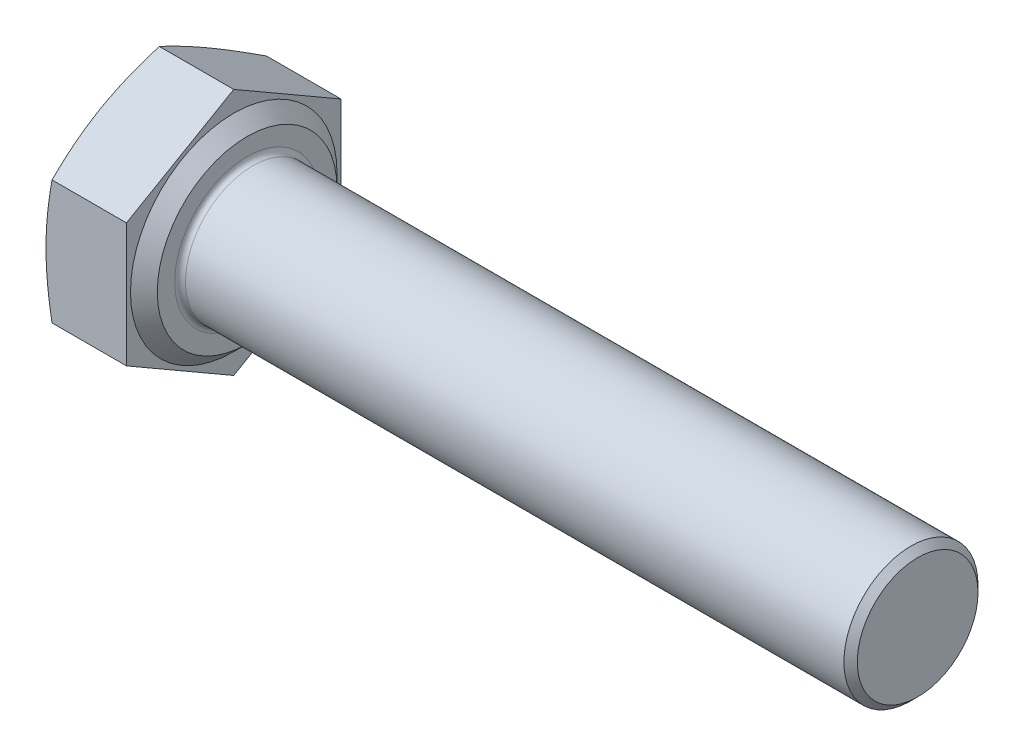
ISO-10303-21;
HEADER;
FILE_DESCRIPTION(('STEP AP214'),'2;1');
FILE_NAME('part.step','',(''),(''),'','','');
FILE_SCHEMA(('AUTOMOTIVE_DESIGN { 1 0 10303 214 1 1 1 1 }'));
ENDSEC;
DATA;
#1=APPLICATION_CONTEXT('core data for automotive mechanical design processes');
#2=APPLICATION_PROTOCOL_DEFINITION('international standard','automotive_design',2000,#1);
#3=PRODUCT_CONTEXT('',#1,'mechanical');
#4=PRODUCT('Part','Part','',(#3));
#5=PRODUCT_RELATED_PRODUCT_CATEGORY('part','',(#4));
#6=PRODUCT_DEFINITION_FORMATION('','',#4);
#7=PRODUCT_DEFINITION_CONTEXT('part definition',#1,'design');
#8=PRODUCT_DEFINITION('design','',#6,#7);
#9=PRODUCT_DEFINITION_SHAPE('','',#8);
#10=(LENGTH_UNIT() NAMED_UNIT(*) SI_UNIT(.MILLI.,.METRE.));
#11=(NAMED_UNIT(*) PLANE_ANGLE_UNIT() SI_UNIT($,.RADIAN.));
#12=(NAMED_UNIT(*) SI_UNIT($,.STERADIAN.) SOLID_ANGLE_UNIT());
#13=UNCERTAINTY_MEASURE_WITH_UNIT(LENGTH_MEASURE(1.E-05),#10,'distance_accuracy_value','');
#14=(GEOMETRIC_REPRESENTATION_CONTEXT(3) GLOBAL_UNCERTAINTY_ASSIGNED_CONTEXT((#13)) GLOBAL_UNIT_ASSIGNED_CONTEXT((#10,
#11,#12)) REPRESENTATION_CONTEXT('',''));
#15=CARTESIAN_POINT('',(0.,0.,0.));
#16=DIRECTION('',(0.,0.,1.));
#17=DIRECTION('',(1.,0.,0.));
#18=AXIS2_PLACEMENT_3D('',#15,#16,#17);
#19=CARTESIAN_POINT('',(3.5,-4.61880215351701,0.));
#20=DIRECTION('',(1.,0.,0.));
#21=DIRECTION('',(0.,0.,-1.));
#22=AXIS2_PLACEMENT_3D('',#19,#20,#21);
#23=PLANE('',#22);
#24=CARTESIAN_POINT('',(3.5,0.,0.));
#25=DIRECTION('',(1.,0.,0.));
#26=DIRECTION('',(0.,0.,-1.));
#27=AXIS2_PLACEMENT_3D('',#24,#25,#26);
#28=CIRCLE('',#27,2.7);
#29=CARTESIAN_POINT('',(3.5,0.,-2.7));
#30=VERTEX_POINT('',#29);
#31=EDGE_CURVE('E11',#30,#30,#28,.F.);
#32=ORIENTED_EDGE('',*,*,#31,.T.);
#33=EDGE_LOOP('',(#32));
#34=FACE_BOUND('',#33,.T.);
#35=CARTESIAN_POINT('',(3.5,0.,0.));
#36=DIRECTION('',(-1.,0.,0.));
#37=DIRECTION('',(0.,0.,1.));
#38=AXIS2_PLACEMENT_3D('',#35,#36,#37);
#39=CIRCLE('',#38,3.35);
#40=CARTESIAN_POINT('',(3.5,0.,3.35));
#41=VERTEX_POINT('',#40);
#42=EDGE_CURVE('E263',#41,#41,#39,.T.);
#43=ORIENTED_EDGE('',*,*,#42,.F.);
#44=EDGE_LOOP('',(#43));
#45=FACE_BOUND('',#44,.T.);
#46=ADVANCED_FACE('F32',(#34,#45),#23,.T.);
#47=CARTESIAN_POINT('',(3.5,-2.3094010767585,4.));
#48=DIRECTION('',(0.,0.866025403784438,-0.5));
#49=DIRECTION('',(0.,0.5,0.866025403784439));
#50=AXIS2_PLACEMENT_3D('',#47,#48,#49);
#51=PLANE('',#50);
#52=CARTESIAN_POINT('',(0.225267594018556,-4.61891762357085,-0.000199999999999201));
#53=CARTESIAN_POINT('',(0.190440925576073,-4.52327074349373,0.165465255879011));
#54=CARTESIAN_POINT('',(0.158759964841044,-4.42730844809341,0.331676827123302));
#55=CARTESIAN_POINT('',(0.103022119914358,-4.23475986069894,0.66518076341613));
#56=CARTESIAN_POINT('',(0.0789712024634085,-4.1381731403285,0.832473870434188));
#57=CARTESIAN_POINT('',(0.040069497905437,-3.9454476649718,1.16628418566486));
#58=CARTESIAN_POINT('',(0.0251338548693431,-3.84931331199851,1.33279376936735));
#59=CARTESIAN_POINT('',(0.00510095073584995,-3.65681977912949,1.66620234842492));
#60=CARTESIAN_POINT('',(0.,-3.56046069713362,1.83310117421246));
#61=CARTESIAN_POINT('',(0.,-3.36774253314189,2.16689882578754));
#62=CARTESIAN_POINT('',(0.00510095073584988,-3.27138345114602,2.33379765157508));
#63=CARTESIAN_POINT('',(0.025133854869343,-3.078889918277,2.66720623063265));
#64=CARTESIAN_POINT('',(0.0400694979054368,-2.98275556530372,2.83371581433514));
#65=CARTESIAN_POINT('',(0.0789712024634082,-2.79003008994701,3.16752612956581));
#66=CARTESIAN_POINT('',(0.103022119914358,-2.69344336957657,3.33481923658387));
#67=CARTESIAN_POINT('',(0.158759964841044,-2.5008947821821,3.6683231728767));
#68=CARTESIAN_POINT('',(0.190440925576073,-2.40493248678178,3.83453474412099));
#69=CARTESIAN_POINT('',(0.225267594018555,-2.30928560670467,4.0002));
#70=B_SPLINE_CURVE_WITH_KNOTS('',3,(#52,#53,#54,#55,#56,#57,#58,#59,#60,#61,#62,#63,#64,#65,#66,
#67,#68,#69),.UNSPECIFIED.,.F.,.F.,(4,2,2,2,2,2,2,2,4),(0.,0.583374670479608,1.16720442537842,
1.74551281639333,2.32360420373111,2.90169559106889,3.4800039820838,4.06383373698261,
4.64720840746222),.UNSPECIFIED.);
#71=CARTESIAN_POINT('',(0.225225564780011,-4.61880215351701,0.));
#72=VERTEX_POINT('',#71);
#73=CARTESIAN_POINT('',(0.,-3.46410161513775,2.));
#74=VERTEX_POINT('',#73);
#75=EDGE_CURVE('E277',#72,#74,#70,.T.);
#76=ORIENTED_EDGE('',*,*,#75,.F.);
#77=DIRECTION('',(-1.,0.,0.));
#78=VECTOR('',#77,1.);
#79=CARTESIAN_POINT('',(3.5,-4.61880215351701,0.));
#80=LINE('',#79,#78);
#81=CARTESIAN_POINT('',(3.,-4.61880215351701,0.));
#82=VERTEX_POINT('',#81);
#83=EDGE_CURVE('E142',#82,#72,#80,.T.);
#84=ORIENTED_EDGE('',*,*,#83,.F.);
#85=DIRECTION('',(0.,-0.5,-0.866025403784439));
#86=VECTOR('',#85,1.);
#87=CARTESIAN_POINT('',(3.,-2.3094010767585,4.));
#88=LINE('',#87,#86);
#89=CARTESIAN_POINT('',(3.,-2.3094010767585,4.));
#90=VERTEX_POINT('',#89);
#91=EDGE_CURVE('E133',#90,#82,#88,.T.);
#92=ORIENTED_EDGE('',*,*,#91,.F.);
#93=DIRECTION('',(-1.,0.,0.));
#94=VECTOR('',#93,1.);
#95=CARTESIAN_POINT('',(3.5,-2.3094010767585,4.));
#96=LINE('',#95,#94);
#97=CARTESIAN_POINT('',(0.225225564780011,-2.3094010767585,4.));
#98=VERTEX_POINT('',#97);
#99=EDGE_CURVE('E128',#90,#98,#96,.T.);
#100=ORIENTED_EDGE('',*,*,#99,.T.);
#101=EDGE_CURVE('E121',#74,#98,#70,.T.);
#102=ORIENTED_EDGE('',*,*,#101,.F.);
#103=EDGE_LOOP('',(#76,#84,#92,#100,#102));
#104=FACE_BOUND('',#103,.T.);
#105=ADVANCED_FACE('F34',(#104),#51,.F.);
#106=CARTESIAN_POINT('',(3.5,-4.61880215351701,0.));
#107=DIRECTION('',(0.,0.866025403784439,0.5));
#108=DIRECTION('',(0.,-0.5,0.866025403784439));
#109=AXIS2_PLACEMENT_3D('',#106,#107,#108);
#110=PLANE('',#109);
#111=CARTESIAN_POINT('',(0.225267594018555,-2.30928560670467,-4.0002));
#112=CARTESIAN_POINT('',(0.190440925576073,-2.40493248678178,-3.83453474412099));
#113=CARTESIAN_POINT('',(0.158759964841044,-2.50089478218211,-3.6683231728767));
#114=CARTESIAN_POINT('',(0.103022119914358,-2.69344336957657,-3.33481923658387));
#115=CARTESIAN_POINT('',(0.0789712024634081,-2.79003008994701,-3.16752612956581));
#116=CARTESIAN_POINT('',(0.0400694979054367,-2.98275556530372,-2.83371581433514));
#117=CARTESIAN_POINT('',(0.0251338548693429,-3.078889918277,-2.66720623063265));
#118=CARTESIAN_POINT('',(0.00510095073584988,-3.27138345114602,-2.33379765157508));
#119=CARTESIAN_POINT('',(0.,-3.36774253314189,-2.16689882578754));
#120=CARTESIAN_POINT('',(0.,-3.56046069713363,-1.83310117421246));
#121=CARTESIAN_POINT('',(0.00510095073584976,-3.65681977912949,-1.66620234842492));
#122=CARTESIAN_POINT('',(0.025133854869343,-3.84931331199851,-1.33279376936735));
#123=CARTESIAN_POINT('',(0.040069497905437,-3.9454476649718,-1.16628418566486));
#124=CARTESIAN_POINT('',(0.0789712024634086,-4.1381731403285,-0.832473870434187));
#125=CARTESIAN_POINT('',(0.103022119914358,-4.23475986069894,-0.66518076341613));
#126=CARTESIAN_POINT('',(0.158759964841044,-4.42730844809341,-0.331676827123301));
#127=CARTESIAN_POINT('',(0.190440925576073,-4.52327074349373,-0.16546525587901));
#128=CARTESIAN_POINT('',(0.225267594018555,-4.61891762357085,0.00020000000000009));
#129=B_SPLINE_CURVE_WITH_KNOTS('',3,(#111,#112,#113,#114,#115,#116,#117,#118,#119,#120,#121,
#122,#123,#124,#125,#126,#127,#128),.UNSPECIFIED.,.F.,.F.,(4,2,2,2,2,2,2,2,4),(0.,
0.583374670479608,1.16720442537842,1.74551281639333,2.32360420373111,2.90169559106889,
3.4800039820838,4.06383373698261,4.64720840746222),.UNSPECIFIED.);
#130=CARTESIAN_POINT('',(0.225225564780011,-2.3094010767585,-4.));
#131=VERTEX_POINT('',#130);
#132=CARTESIAN_POINT('',(0.,-3.46410161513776,-2.));
#133=VERTEX_POINT('',#132);
#134=EDGE_CURVE('E230',#131,#133,#129,.T.);
#135=ORIENTED_EDGE('',*,*,#134,.F.);
#136=DIRECTION('',(-1.,0.,0.));
#137=VECTOR('',#136,1.);
#138=CARTESIAN_POINT('',(3.5,-2.30940107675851,-4.));
#139=LINE('',#138,#137);
#140=CARTESIAN_POINT('',(3.,-2.3094010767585,-4.));
#141=VERTEX_POINT('',#140);
#142=EDGE_CURVE('E139',#141,#131,#139,.T.);
#143=ORIENTED_EDGE('',*,*,#142,.F.);
#144=DIRECTION('',(0.,0.5,-0.866025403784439));
#145=VECTOR('',#144,1.);
#146=CARTESIAN_POINT('',(3.,-4.61880215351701,0.));
#147=LINE('',#146,#145);
#148=EDGE_CURVE('E267',#82,#141,#147,.T.);
#149=ORIENTED_EDGE('',*,*,#148,.F.);
#150=ORIENTED_EDGE('',*,*,#83,.T.);
#151=EDGE_CURVE('E226',#133,#72,#129,.T.);
#152=ORIENTED_EDGE('',*,*,#151,.F.);
#153=EDGE_LOOP('',(#135,#143,#149,#150,#152));
#154=FACE_BOUND('',#153,.T.);
#155=ADVANCED_FACE('F180',(#154),#110,.F.);
#156=CARTESIAN_POINT('',(3.5,-2.30940107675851,-4.));
#157=DIRECTION('',(0.,0.,1.));
#158=DIRECTION('',(1.,0.,0.));
#159=AXIS2_PLACEMENT_3D('',#156,#157,#158);
#160=PLANE('',#159);
#161=CARTESIAN_POINT('',(1.20351609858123,-6.11448201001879,-4.));
#162=CARTESIAN_POINT('',(1.14840944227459,-5.93350754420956,-4.));
#163=CARTESIAN_POINT('',(1.0939458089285,-5.75233363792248,-4.));
#164=CARTESIAN_POINT('',(0.986660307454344,-5.38948540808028,-4.));
#165=CARTESIAN_POINT('',(0.93383856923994,-5.20781104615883,-4.));
#166=CARTESIAN_POINT('',(0.830104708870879,-4.84354941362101,-4.));
#167=CARTESIAN_POINT('',(0.779196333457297,-4.66096107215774,-4.));
#168=CARTESIAN_POINT('',(0.679885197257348,-4.29510518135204,-4.));
#169=CARTESIAN_POINT('',(0.631482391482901,-4.11183764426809,-4.));
#170=CARTESIAN_POINT('',(0.538379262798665,-3.74676129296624,-4.));
#171=CARTESIAN_POINT('',(0.493640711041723,-3.56496227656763,-4.));
#172=CARTESIAN_POINT('',(0.407974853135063,-3.20046880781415,-4.));
#173=CARTESIAN_POINT('',(0.367047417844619,-3.01777438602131,-4.));
#174=CARTESIAN_POINT('',(0.289954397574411,-2.65143543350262,-4.));
#175=CARTESIAN_POINT('',(0.253787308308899,-2.46779122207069,-4.));
#176=CARTESIAN_POINT('',(0.18731747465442,-2.09943661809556,-4.));
#177=CARTESIAN_POINT('',(0.157014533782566,-1.91472626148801,-4.));
#178=CARTESIAN_POINT('',(0.106503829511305,-1.5650339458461,-4.));
#179=CARTESIAN_POINT('',(0.0855452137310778,-1.40016146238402,-4.));
#180=CARTESIAN_POINT('',(0.0500684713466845,-1.06972842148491,-4.));
#181=CARTESIAN_POINT('',(0.0355498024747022,-0.904167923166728,-4.));
#182=CARTESIAN_POINT('',(0.0136501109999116,-0.572681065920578,-4.));
#183=CARTESIAN_POINT('',(0.00626423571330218,-0.406755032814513,-4.));
#184=CARTESIAN_POINT('',(-0.000995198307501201,-0.0747369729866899,-4.));
#185=CARTESIAN_POINT('',(-0.000868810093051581,0.0913550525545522,-4.));
#186=CARTESIAN_POINT('',(0.00690897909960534,0.424202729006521,-4.));
#187=CARTESIAN_POINT('',(0.0145985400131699,0.59095747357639,-4.));
#188=CARTESIAN_POINT('',(0.0371492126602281,0.923977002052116,-4.));
#189=CARTESIAN_POINT('',(0.0520104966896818,1.09024177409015,-4.));
#190=CARTESIAN_POINT('',(0.0882078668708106,1.42220001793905,-4.));
#191=CARTESIAN_POINT('',(0.109549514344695,1.58789287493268,-4.));
#192=CARTESIAN_POINT('',(0.157847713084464,1.91844743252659,-4.));
#193=CARTESIAN_POINT('',(0.184804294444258,2.08330912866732,-4.));
#194=CARTESIAN_POINT('',(0.27584694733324,2.59401202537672,-4.));
#195=CARTESIAN_POINT('',(0.348030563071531,2.93840559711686,-4.));
#196=CARTESIAN_POINT('',(0.506289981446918,3.62399444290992,-4.));
#197=CARTESIAN_POINT('',(0.592370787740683,3.96518851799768,-4.));
#198=CARTESIAN_POINT('',(0.773793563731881,4.64555454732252,-4.));
#199=CARTESIAN_POINT('',(0.869147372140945,4.98472331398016,-4.));
#200=CARTESIAN_POINT('',(1.06598925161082,5.66119963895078,-4.));
#201=CARTESIAN_POINT('',(1.16747634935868,5.99850748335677,-4.));
#202=CARTESIAN_POINT('',(1.37355112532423,6.66809503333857,-4.));
#203=CARTESIAN_POINT('',(1.47809221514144,7.00038914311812,-4.));
#204=CARTESIAN_POINT('',(1.69014386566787,7.66404294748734,-4.));
#205=CARTESIAN_POINT('',(1.79765456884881,7.99540259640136,-4.));
#206=CARTESIAN_POINT('',(2.0144284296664,8.65615404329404,-4.));
#207=CARTESIAN_POINT('',(2.1236833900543,8.98554853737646,-4.));
#208=CARTESIAN_POINT('',(2.34383141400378,9.6437599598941,-4.));
#209=CARTESIAN_POINT('',(2.45472434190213,9.9725769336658,-4.));
#210=CARTESIAN_POINT('',(2.56619031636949,10.301196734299,-4.));
#211=B_SPLINE_CURVE_WITH_KNOTS('',3,(#161,#162,#163,#164,#165,#166,#167,#168,#169,#170,#171,
#172,#173,#174,#175,#176,#177,#178,#179,#180,#181,#182,#183,#184,#185,#186,#187,#188,#189,#190,
#191,#192,#193,#194,#195,#196,#197,#198,#199,#200,#201,#202,#203,#204,#205,#206,#207,#208,#209,
#210),.UNSPECIFIED.,.F.,.F.,(4,2,2,2,2,2,2,2,2,2,2,2,2,2,2,2,2,2,2,2,2,2,2,2,4),(0.,
0.567539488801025,1.13512376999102,1.70376702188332,2.27240006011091,2.83403638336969,
3.39565366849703,3.95709305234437,4.51851362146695,5.0170019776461,5.51544835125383,
6.01355537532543,6.51165888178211,7.01228852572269,7.51293019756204,8.01400273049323,
8.51507794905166,9.57019556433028,10.6256939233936,11.682557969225,12.7392547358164,
13.7842878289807,14.8293711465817,15.8704890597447,16.911521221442),.UNSPECIFIED.);
#212=CARTESIAN_POINT('',(0.225225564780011,2.30940107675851,-4.));
#213=VERTEX_POINT('',#212);
#214=CARTESIAN_POINT('',(0.,0.,-4.));
#215=VERTEX_POINT('',#214);
#216=EDGE_CURVE('E293',#213,#215,#211,.F.);
#217=ORIENTED_EDGE('',*,*,#216,.F.);
#218=DIRECTION('',(-1.,0.,0.));
#219=VECTOR('',#218,1.);
#220=CARTESIAN_POINT('',(3.5,2.3094010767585,-4.));
#221=LINE('',#220,#219);
#222=CARTESIAN_POINT('',(3.,2.30940107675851,-4.));
#223=VERTEX_POINT('',#222);
#224=EDGE_CURVE('E130',#223,#213,#221,.T.);
#225=ORIENTED_EDGE('',*,*,#224,.F.);
#226=DIRECTION('',(0.,1.,0.));
#227=VECTOR('',#226,1.);
#228=CARTESIAN_POINT('',(3.,-2.30940107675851,-4.));
#229=LINE('',#228,#227);
#230=EDGE_CURVE('E260',#141,#223,#229,.T.);
#231=ORIENTED_EDGE('',*,*,#230,.F.);
#232=ORIENTED_EDGE('',*,*,#142,.T.);
#233=EDGE_CURVE('E231',#215,#131,#211,.F.);
#234=ORIENTED_EDGE('',*,*,#233,.F.);
#235=EDGE_LOOP('',(#217,#225,#231,#232,#234));
#236=FACE_BOUND('',#235,.T.);
#237=ADVANCED_FACE('F239',(#236),#160,.F.);
#238=CARTESIAN_POINT('',(3.5,2.3094010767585,-4.));
#239=DIRECTION('',(0.,-0.866025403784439,0.5));
#240=DIRECTION('',(0.,-0.5,-0.866025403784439));
#241=AXIS2_PLACEMENT_3D('',#238,#239,#240);
#242=PLANE('',#241);
#243=CARTESIAN_POINT('',(0.225267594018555,4.61891762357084,0.000199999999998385));
#244=CARTESIAN_POINT('',(0.190440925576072,4.52327074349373,-0.165465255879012));
#245=CARTESIAN_POINT('',(0.158759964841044,4.42730844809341,-0.331676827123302));
#246=CARTESIAN_POINT('',(0.103022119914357,4.23475986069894,-0.665180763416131));
#247=CARTESIAN_POINT('',(0.078971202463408,4.1381731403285,-0.832473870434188));
#248=CARTESIAN_POINT('',(0.0400694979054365,3.9454476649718,-1.16628418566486));
#249=CARTESIAN_POINT('',(0.0251338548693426,3.84931331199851,-1.33279376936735));
#250=CARTESIAN_POINT('',(0.00510095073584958,3.65681977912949,-1.66620234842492));
#251=CARTESIAN_POINT('',(0.,3.56046069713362,-1.83310117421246));
#252=CARTESIAN_POINT('',(0.,3.36774253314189,-2.16689882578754));
#253=CARTESIAN_POINT('',(0.00510095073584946,3.27138345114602,-2.33379765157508));
#254=CARTESIAN_POINT('',(0.0251338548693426,3.078889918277,-2.66720623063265));
#255=CARTESIAN_POINT('',(0.0400694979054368,2.98275556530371,-2.83371581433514));
#256=CARTESIAN_POINT('',(0.0789712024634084,2.79003008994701,-3.16752612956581));
#257=CARTESIAN_POINT('',(0.103022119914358,2.69344336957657,-3.33481923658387));
#258=CARTESIAN_POINT('',(0.158759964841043,2.5008947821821,-3.6683231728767));
#259=CARTESIAN_POINT('',(0.190440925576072,2.40493248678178,-3.83453474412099));
#260=CARTESIAN_POINT('',(0.225267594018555,2.30928560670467,-4.0002));
#261=B_SPLINE_CURVE_WITH_KNOTS('',3,(#243,#244,#245,#246,#247,#248,#249,#250,#251,#252,#253,
#254,#255,#256,#257,#258,#259,#260),.UNSPECIFIED.,.F.,.F.,(4,2,2,2,2,2,2,2,4),(0.,
0.583374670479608,1.16720442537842,1.74551281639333,2.32360420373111,2.90169559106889,
3.4800039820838,4.06383373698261,4.64720840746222),.UNSPECIFIED.);
#262=CARTESIAN_POINT('',(0.225225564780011,4.61880215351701,0.));
#263=VERTEX_POINT('',#262);
#264=CARTESIAN_POINT('',(0.,3.46410161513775,-2.));
#265=VERTEX_POINT('',#264);
#266=EDGE_CURVE('E48',#263,#265,#261,.T.);
#267=ORIENTED_EDGE('',*,*,#266,.F.);
#268=DIRECTION('',(-1.,0.,0.));
#269=VECTOR('',#268,1.);
#270=CARTESIAN_POINT('',(3.5,4.61880215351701,0.));
#271=LINE('',#270,#269);
#272=CARTESIAN_POINT('',(3.,4.61880215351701,0.));
#273=VERTEX_POINT('',#272);
#274=EDGE_CURVE('E127',#273,#263,#271,.T.);
#275=ORIENTED_EDGE('',*,*,#274,.F.);
#276=DIRECTION('',(0.,0.5,0.866025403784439));
#277=VECTOR('',#276,1.);
#278=CARTESIAN_POINT('',(3.,2.3094010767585,-4.));
#279=LINE('',#278,#277);
#280=EDGE_CURVE('E257',#223,#273,#279,.T.);
#281=ORIENTED_EDGE('',*,*,#280,.F.);
#282=ORIENTED_EDGE('',*,*,#224,.T.);
#283=EDGE_CURVE('E254',#265,#213,#261,.T.);
#284=ORIENTED_EDGE('',*,*,#283,.F.);
#285=EDGE_LOOP('',(#267,#275,#281,#282,#284));
#286=FACE_BOUND('',#285,.T.);
#287=ADVANCED_FACE('F243',(#286),#242,.F.);
#288=CARTESIAN_POINT('',(3.5,4.61880215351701,0.));
#289=DIRECTION('',(0.,-0.866025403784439,-0.5));
#290=DIRECTION('',(0.,0.5,-0.866025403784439));
#291=AXIS2_PLACEMENT_3D('',#288,#289,#290);
#292=PLANE('',#291);
#293=CARTESIAN_POINT('',(0.225267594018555,2.30928560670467,4.0002));
#294=CARTESIAN_POINT('',(0.190440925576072,2.40493248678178,3.83453474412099));
#295=CARTESIAN_POINT('',(0.158759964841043,2.5008947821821,3.6683231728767));
#296=CARTESIAN_POINT('',(0.103022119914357,2.69344336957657,3.33481923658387));
#297=CARTESIAN_POINT('',(0.078971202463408,2.79003008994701,3.16752612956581));
#298=CARTESIAN_POINT('',(0.0400694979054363,2.98275556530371,2.83371581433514));
#299=CARTESIAN_POINT('',(0.0251338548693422,3.078889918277,2.66720623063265));
#300=CARTESIAN_POINT('',(0.00510095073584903,3.27138345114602,2.33379765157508));
#301=CARTESIAN_POINT('',(0.,3.36774253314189,2.16689882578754));
#302=CARTESIAN_POINT('',(0.,3.56046069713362,1.83310117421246));
#303=CARTESIAN_POINT('',(0.00510095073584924,3.65681977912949,1.66620234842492));
#304=CARTESIAN_POINT('',(0.0251338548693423,3.84931331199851,1.33279376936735));
#305=CARTESIAN_POINT('',(0.0400694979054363,3.9454476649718,1.16628418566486));
#306=CARTESIAN_POINT('',(0.0789712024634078,4.1381731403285,0.832473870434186));
#307=CARTESIAN_POINT('',(0.103022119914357,4.23475986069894,0.665180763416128));
#308=CARTESIAN_POINT('',(0.158759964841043,4.42730844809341,0.3316768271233));
#309=CARTESIAN_POINT('',(0.190440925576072,4.52327074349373,0.165465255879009));
#310=CARTESIAN_POINT('',(0.225267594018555,4.61891762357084,-0.000200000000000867));
#311=B_SPLINE_CURVE_WITH_KNOTS('',3,(#293,#294,#295,#296,#297,#298,#299,#300,#301,#302,#303,
#304,#305,#306,#307,#308,#309,#310),.UNSPECIFIED.,.F.,.F.,(4,2,2,2,2,2,2,2,4),(0.,
0.583374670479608,1.16720442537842,1.74551281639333,2.32360420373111,2.90169559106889,
3.4800039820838,4.06383373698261,4.64720840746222),.UNSPECIFIED.);
#312=CARTESIAN_POINT('',(0.225225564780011,2.3094010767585,4.));
#313=VERTEX_POINT('',#312);
#314=CARTESIAN_POINT('',(0.,3.46410161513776,2.));
#315=VERTEX_POINT('',#314);
#316=EDGE_CURVE('E56',#313,#315,#311,.T.);
#317=ORIENTED_EDGE('',*,*,#316,.F.);
#318=DIRECTION('',(-1.,0.,0.));
#319=VECTOR('',#318,1.);
#320=CARTESIAN_POINT('',(3.5,2.3094010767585,4.));
#321=LINE('',#320,#319);
#322=CARTESIAN_POINT('',(3.,2.3094010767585,4.));
#323=VERTEX_POINT('',#322);
#324=EDGE_CURVE('E118',#323,#313,#321,.T.);
#325=ORIENTED_EDGE('',*,*,#324,.F.);
#326=DIRECTION('',(0.,-0.5,0.866025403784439));
#327=VECTOR('',#326,1.);
#328=CARTESIAN_POINT('',(3.,4.61880215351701,0.));
#329=LINE('',#328,#327);
#330=EDGE_CURVE('E255',#273,#323,#329,.T.);
#331=ORIENTED_EDGE('',*,*,#330,.F.);
#332=ORIENTED_EDGE('',*,*,#274,.T.);
#333=EDGE_CURVE('E120',#315,#263,#311,.T.);
#334=ORIENTED_EDGE('',*,*,#333,.F.);
#335=EDGE_LOOP('',(#317,#325,#331,#332,#334));
#336=FACE_BOUND('',#335,.T.);
#337=ADVANCED_FACE('F116',(#336),#292,.F.);
#338=CARTESIAN_POINT('',(3.5,2.3094010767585,4.));
#339=DIRECTION('',(0.,0.,-1.));
#340=DIRECTION('',(0.,1.,0.));
#341=AXIS2_PLACEMENT_3D('',#338,#339,#340);
#342=PLANE('',#341);
#343=CARTESIAN_POINT('',(1.20351631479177,-6.11448271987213,4.));
#344=CARTESIAN_POINT('',(1.14840964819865,-5.93350822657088,4.));
#345=CARTESIAN_POINT('',(1.09394600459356,-5.75233429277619,4.));
#346=CARTESIAN_POINT('',(0.98666048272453,-5.38948600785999,4.));
#347=CARTESIAN_POINT('',(0.933838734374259,-5.20781161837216,4.));
#348=CARTESIAN_POINT('',(0.830104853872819,-4.84354993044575,4.));
#349=CARTESIAN_POINT('',(0.779196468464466,-4.66096156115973,4.));
#350=CARTESIAN_POINT('',(0.679885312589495,-4.29510561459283,4.));
#351=CARTESIAN_POINT('',(0.63148249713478,-4.11183804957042,4.));
#352=CARTESIAN_POINT('',(0.538379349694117,-3.74676164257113,4.));
#353=CARTESIAN_POINT('',(0.493640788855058,-3.56496259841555,4.));
#354=CARTESIAN_POINT('',(0.407974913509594,-3.20046907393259,4.));
#355=CARTESIAN_POINT('',(0.367047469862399,-3.01777462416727,4.));
#356=CARTESIAN_POINT('',(0.289954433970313,-2.65143561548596,4.));
#357=CARTESIAN_POINT('',(0.253787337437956,-2.46779137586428,4.));
#358=CARTESIAN_POINT('',(0.187317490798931,-2.09943671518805,4.));
#359=CARTESIAN_POINT('',(0.15701454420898,-1.91472633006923,4.));
#360=CARTESIAN_POINT('',(0.106503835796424,-1.565033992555,4.));
#361=CARTESIAN_POINT('',(0.0855452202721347,-1.40016151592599,4.));
#362=CARTESIAN_POINT('',(0.0500684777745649,-1.06972848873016,4.));
#363=CARTESIAN_POINT('',(0.0355498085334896,-0.904167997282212,4.));
#364=CARTESIAN_POINT('',(0.0136501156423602,-0.572681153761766,4.));
#365=CARTESIAN_POINT('',(0.00626423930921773,-0.406755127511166,4.));
#366=CARTESIAN_POINT('',(-0.000995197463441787,-0.0747370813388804,4.));
#367=CARTESIAN_POINT('',(-0.000868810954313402,0.0913549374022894,4.));
#368=CARTESIAN_POINT('',(0.00690897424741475,0.424202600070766,4.));
#369=CARTESIAN_POINT('',(0.0145985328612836,0.590957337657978,4.));
#370=CARTESIAN_POINT('',(0.037149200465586,0.923976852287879,4.));
#371=CARTESIAN_POINT('',(0.0520104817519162,1.09024161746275,4.));
#372=CARTESIAN_POINT('',(0.0882078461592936,1.42219984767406,4.));
#373=CARTESIAN_POINT('',(0.109549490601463,1.58789269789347,4.));
#374=CARTESIAN_POINT('',(0.157847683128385,1.91844724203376,4.));
#375=CARTESIAN_POINT('',(0.184804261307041,2.0833089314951,4.));
#376=CARTESIAN_POINT('',(0.275846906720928,2.59401182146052,4.));
#377=CARTESIAN_POINT('',(0.348030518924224,2.93840539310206,4.));
#378=CARTESIAN_POINT('',(0.506289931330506,3.62399423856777,4.));
#379=CARTESIAN_POINT('',(0.59237073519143,3.96518831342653,4.));
#380=CARTESIAN_POINT('',(0.773793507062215,4.64555434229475,4.));
#381=CARTESIAN_POINT('',(0.869147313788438,4.98472310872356,4.));
#382=CARTESIAN_POINT('',(1.06598919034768,5.66119943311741,4.));
#383=CARTESIAN_POINT('',(1.16747628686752,5.99850727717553,4.));
#384=CARTESIAN_POINT('',(1.37355106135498,6.66809482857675,4.));
#385=CARTESIAN_POINT('',(1.47809215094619,7.00038894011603,4.));
#386=CARTESIAN_POINT('',(1.69014380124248,7.66404274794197,4.));
#387=CARTESIAN_POINT('',(1.79765450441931,7.99540239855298,4.));
#388=CARTESIAN_POINT('',(2.01442836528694,8.65615384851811,4.));
#389=CARTESIAN_POINT('',(2.12368332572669,8.98554834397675,4.));
#390=CARTESIAN_POINT('',(2.34383134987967,9.64375976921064,4.));
#391=CARTESIAN_POINT('',(2.45472427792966,9.97257674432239,4.));
#392=CARTESIAN_POINT('',(2.56619025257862,10.3011965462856,4.));
#393=B_SPLINE_CURVE_WITH_KNOTS('',3,(#343,#344,#345,#346,#347,#348,#349,#350,#351,#352,#353,
#354,#355,#356,#357,#358,#359,#360,#361,#362,#363,#364,#365,#366,#367,#368,#369,#370,#371,#372,
#373,#374,#375,#376,#377,#378,#379,#380,#381,#382,#383,#384,#385,#386,#387,#388,#389,#390,#391,
#392),.UNSPECIFIED.,.F.,.F.,(4,2,2,2,2,2,2,2,2,2,2,2,2,2,2,2,2,2,2,2,2,2,2,2,4),(0.,
0.56753957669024,1.13512394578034,1.70376728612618,2.27240041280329,2.83403682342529,
3.39565419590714,3.95709366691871,4.51851432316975,5.01700265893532,5.51544901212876,
6.01355601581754,6.51165950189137,7.01228912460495,7.5129307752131,8.01400328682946,
8.51507848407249,9.57019609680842,10.6256944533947,11.6825584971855,12.7392552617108,
13.7842883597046,14.8293716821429,15.870489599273,16.9115217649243),.UNSPECIFIED.);
#394=CARTESIAN_POINT('',(0.,0.,4.));
#395=VERTEX_POINT('',#394);
#396=EDGE_CURVE('E111',#98,#395,#393,.T.);
#397=ORIENTED_EDGE('',*,*,#396,.F.);
#398=ORIENTED_EDGE('',*,*,#99,.F.);
#399=DIRECTION('',(0.,-1.,0.));
#400=VECTOR('',#399,1.);
#401=CARTESIAN_POINT('',(3.,2.3094010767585,4.));
#402=LINE('',#401,#400);
#403=EDGE_CURVE('E126',#323,#90,#402,.T.);
#404=ORIENTED_EDGE('',*,*,#403,.F.);
#405=ORIENTED_EDGE('',*,*,#324,.T.);
#406=EDGE_CURVE('E103',#395,#313,#393,.T.);
#407=ORIENTED_EDGE('',*,*,#406,.F.);
#408=EDGE_LOOP('',(#397,#398,#404,#405,#407));
#409=FACE_BOUND('',#408,.T.);
#410=ADVANCED_FACE('F124',(#409),#342,.F.);
#411=CARTESIAN_POINT('',(3.,3.85000000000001,0.));
#412=DIRECTION('',(1.,0.,0.));
#413=DIRECTION('',(0.,0.,-1.));
#414=AXIS2_PLACEMENT_3D('',#411,#412,#413);
#415=PLANE('',#414);
#416=CARTESIAN_POINT('',(3.,0.,0.));
#417=DIRECTION('',(-1.,0.,0.));
#418=DIRECTION('',(0.,0.,1.));
#419=AXIS2_PLACEMENT_3D('',#416,#417,#418);
#420=CIRCLE('',#419,3.85000000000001);
#421=CARTESIAN_POINT('',(3.,0.,3.85000000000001));
#422=VERTEX_POINT('',#421);
#423=EDGE_CURVE('E258',#422,#422,#420,.T.);
#424=ORIENTED_EDGE('',*,*,#423,.T.);
#425=EDGE_LOOP('',(#424));
#426=FACE_BOUND('',#425,.T.);
#427=ORIENTED_EDGE('',*,*,#91,.T.);
#428=ORIENTED_EDGE('',*,*,#148,.T.);
#429=ORIENTED_EDGE('',*,*,#230,.T.);
#430=ORIENTED_EDGE('',*,*,#280,.T.);
#431=ORIENTED_EDGE('',*,*,#330,.T.);
#432=ORIENTED_EDGE('',*,*,#403,.T.);
#433=EDGE_LOOP('',(#427,#428,#429,#430,#431,#432));
#434=FACE_BOUND('',#433,.T.);
#435=ADVANCED_FACE('F190',(#426,#434),#415,.T.);
#436=CARTESIAN_POINT('',(3.,0.,0.));
#437=DIRECTION('',(-1.,0.,0.));
#438=DIRECTION('',(0.,0.,1.));
#439=AXIS2_PLACEMENT_3D('',#436,#437,#438);
#440=CONICAL_SURFACE('',#439,3.85000000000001,0.785398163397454);
#441=ORIENTED_EDGE('',*,*,#42,.T.);
#442=EDGE_LOOP('',(#441));
#443=FACE_BOUND('',#442,.T.);
#444=ORIENTED_EDGE('',*,*,#423,.F.);
#445=EDGE_LOOP('',(#444));
#446=FACE_BOUND('',#445,.T.);
#447=ADVANCED_FACE('F211',(#443,#446),#440,.T.);
#448=CARTESIAN_POINT('',(0.,0.,0.));
#449=DIRECTION('',(1.,0.,0.));
#450=DIRECTION('',(0.,0.,-1.));
#451=AXIS2_PLACEMENT_3D('',#448,#449,#450);
#452=CONICAL_SURFACE('',#451,4.,1.22173047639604);
#453=ORIENTED_EDGE('',*,*,#233,.T.);
#454=ORIENTED_EDGE('',*,*,#134,.T.);
#455=CARTESIAN_POINT('',(0.,0.,0.));
#456=DIRECTION('',(1.,0.,0.));
#457=DIRECTION('',(0.,0.,-1.));
#458=AXIS2_PLACEMENT_3D('',#455,#456,#457);
#459=CIRCLE('',#458,4.);
#460=EDGE_CURVE('E146',#133,#215,#459,.T.);
#461=ORIENTED_EDGE('',*,*,#460,.T.);
#462=EDGE_LOOP('',(#453,#454,#461));
#463=FACE_BOUND('',#462,.T.);
#464=ADVANCED_FACE('F209',(#463),#452,.T.);
#465=ORIENTED_EDGE('',*,*,#151,.T.);
#466=ORIENTED_EDGE('',*,*,#75,.T.);
#467=EDGE_CURVE('E149',#74,#133,#459,.T.);
#468=ORIENTED_EDGE('',*,*,#467,.T.);
#469=EDGE_LOOP('',(#465,#466,#468));
#470=FACE_BOUND('',#469,.T.);
#471=ADVANCED_FACE('F289',(#470),#452,.T.);
#472=ORIENTED_EDGE('',*,*,#101,.T.);
#473=ORIENTED_EDGE('',*,*,#396,.T.);
#474=EDGE_CURVE('E282',#395,#74,#459,.T.);
#475=ORIENTED_EDGE('',*,*,#474,.T.);
#476=EDGE_LOOP('',(#472,#473,#475));
#477=FACE_BOUND('',#476,.T.);
#478=ADVANCED_FACE('F281',(#477),#452,.T.);
#479=ORIENTED_EDGE('',*,*,#316,.T.);
#480=CARTESIAN_POINT('',(0.,0.,0.));
#481=DIRECTION('',(-1.,0.,0.));
#482=DIRECTION('',(0.,0.,1.));
#483=AXIS2_PLACEMENT_3D('',#480,#481,#482);
#484=CIRCLE('',#483,4.);
#485=EDGE_CURVE('E106',#395,#315,#484,.T.);
#486=ORIENTED_EDGE('',*,*,#485,.F.);
#487=ORIENTED_EDGE('',*,*,#406,.T.);
#488=EDGE_LOOP('',(#479,#486,#487));
#489=FACE_BOUND('',#488,.T.);
#490=ADVANCED_FACE('F104',(#489),#452,.T.);
#491=ORIENTED_EDGE('',*,*,#266,.T.);
#492=EDGE_CURVE('E285',#265,#315,#459,.T.);
#493=ORIENTED_EDGE('',*,*,#492,.T.);
#494=ORIENTED_EDGE('',*,*,#333,.T.);
#495=EDGE_LOOP('',(#491,#493,#494));
#496=FACE_BOUND('',#495,.T.);
#497=ADVANCED_FACE('F207',(#496),#452,.T.);
#498=ORIENTED_EDGE('',*,*,#216,.T.);
#499=EDGE_CURVE('E150',#215,#265,#459,.T.);
#500=ORIENTED_EDGE('',*,*,#499,.T.);
#501=ORIENTED_EDGE('',*,*,#283,.T.);
#502=EDGE_LOOP('',(#498,#500,#501));
#503=FACE_BOUND('',#502,.T.);
#504=ADVANCED_FACE('F202',(#503),#452,.T.);
#505=CARTESIAN_POINT('',(0.,-4.61880215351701,0.));
#506=DIRECTION('',(1.,0.,0.));
#507=DIRECTION('',(0.,0.,-1.));
#508=AXIS2_PLACEMENT_3D('',#505,#506,#507);
#509=PLANE('',#508);
#510=ORIENTED_EDGE('',*,*,#499,.F.);
#511=ORIENTED_EDGE('',*,*,#460,.F.);
#512=ORIENTED_EDGE('',*,*,#467,.F.);
#513=ORIENTED_EDGE('',*,*,#474,.F.);
#514=ORIENTED_EDGE('',*,*,#485,.T.);
#515=ORIENTED_EDGE('',*,*,#492,.F.);
#516=EDGE_LOOP('',(#510,#511,#512,#513,#514,#515));
#517=FACE_BOUND('',#516,.T.);
#518=ADVANCED_FACE('F185',(#517),#509,.F.);
#519=CARTESIAN_POINT('',(28.5,0.,0.));
#520=DIRECTION('',(-1.,0.,0.));
#521=DIRECTION('',(0.,0.,1.));
#522=AXIS2_PLACEMENT_3D('',#519,#520,#521);
#523=CYLINDRICAL_SURFACE('',#522,2.5);
#524=CARTESIAN_POINT('',(3.7,0.,0.));
#525=DIRECTION('',(1.,0.,0.));
#526=DIRECTION('',(0.,0.,-1.));
#527=AXIS2_PLACEMENT_3D('',#524,#525,#526);
#528=CIRCLE('',#527,2.5);
#529=CARTESIAN_POINT('',(3.7,0.,-2.5));
#530=VERTEX_POINT('',#529);
#531=EDGE_CURVE('E41',#530,#530,#528,.T.);
#532=ORIENTED_EDGE('',*,*,#531,.T.);
#533=EDGE_LOOP('',(#532));
#534=FACE_BOUND('',#533,.T.);
#535=CARTESIAN_POINT('',(28.25,0.,0.));
#536=DIRECTION('',(1.,0.,0.));
#537=DIRECTION('',(0.,0.,-1.));
#538=AXIS2_PLACEMENT_3D('',#535,#536,#537);
#539=CIRCLE('',#538,2.5);
#540=CARTESIAN_POINT('',(28.25,0.,-2.5));
#541=VERTEX_POINT('',#540);
#542=EDGE_CURVE('E154',#541,#541,#539,.F.);
#543=ORIENTED_EDGE('',*,*,#542,.T.);
#544=EDGE_LOOP('',(#543));
#545=FACE_BOUND('',#544,.T.);
#546=ADVANCED_FACE('F159',(#534,#545),#523,.T.);
#547=CARTESIAN_POINT('',(28.5,0.,0.));
#548=DIRECTION('',(1.,0.,0.));
#549=DIRECTION('',(0.,0.,-1.));
#550=AXIS2_PLACEMENT_3D('',#547,#548,#549);
#551=PLANE('',#550);
#552=CARTESIAN_POINT('',(28.5,0.,0.));
#553=DIRECTION('',(1.,0.,0.));
#554=DIRECTION('',(0.,0.,-1.));
#555=AXIS2_PLACEMENT_3D('',#552,#553,#554);
#556=CIRCLE('',#555,2.25000000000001);
#557=CARTESIAN_POINT('',(28.5,0.,-2.25000000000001));
#558=VERTEX_POINT('',#557);
#559=EDGE_CURVE('E151',#558,#558,#556,.T.);
#560=ORIENTED_EDGE('',*,*,#559,.T.);
#561=EDGE_LOOP('',(#560));
#562=FACE_BOUND('',#561,.T.);
#563=ADVANCED_FACE('F170',(#562),#551,.T.);
#564=CARTESIAN_POINT('',(28.5,0.,0.));
#565=DIRECTION('',(-1.,0.,0.));
#566=DIRECTION('',(0.,0.,1.));
#567=AXIS2_PLACEMENT_3D('',#564,#565,#566);
#568=CONICAL_SURFACE('',#567,2.25000000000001,0.785398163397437);
#569=ORIENTED_EDGE('',*,*,#542,.F.);
#570=EDGE_LOOP('',(#569));
#571=FACE_BOUND('',#570,.T.);
#572=ORIENTED_EDGE('',*,*,#559,.F.);
#573=EDGE_LOOP('',(#572));
#574=FACE_BOUND('',#573,.T.);
#575=ADVANCED_FACE('F164',(#571,#574),#568,.T.);
#576=CARTESIAN_POINT('',(3.7,0.,0.));
#577=DIRECTION('',(1.,0.,0.));
#578=DIRECTION('',(0.,0.,-1.));
#579=AXIS2_PLACEMENT_3D('',#576,#577,#578);
#580=TOROIDAL_SURFACE('',#579,2.7,0.2);
#581=ORIENTED_EDGE('',*,*,#31,.F.);
#582=EDGE_LOOP('',(#581));
#583=FACE_BOUND('',#582,.T.);
#584=ORIENTED_EDGE('',*,*,#531,.F.);
#585=EDGE_LOOP('',(#584));
#586=FACE_BOUND('',#585,.T.);
#587=ADVANCED_FACE('F162',(#583,#586),#580,.F.);
#588=CLOSED_SHELL('',(#46,#105,#155,#237,#287,#337,#410,#435,#447,#464,#471,#478,#490,#497,#504,
#518,#546,#563,#575,#587));
#589=MANIFOLD_SOLID_BREP('B2',#588);
#590=ADVANCED_BREP_SHAPE_REPRESENTATION('',(#18,#589),#14);
#591=SHAPE_DEFINITION_REPRESENTATION(#9,#590);
ENDSEC;
END-ISO-10303-21;
